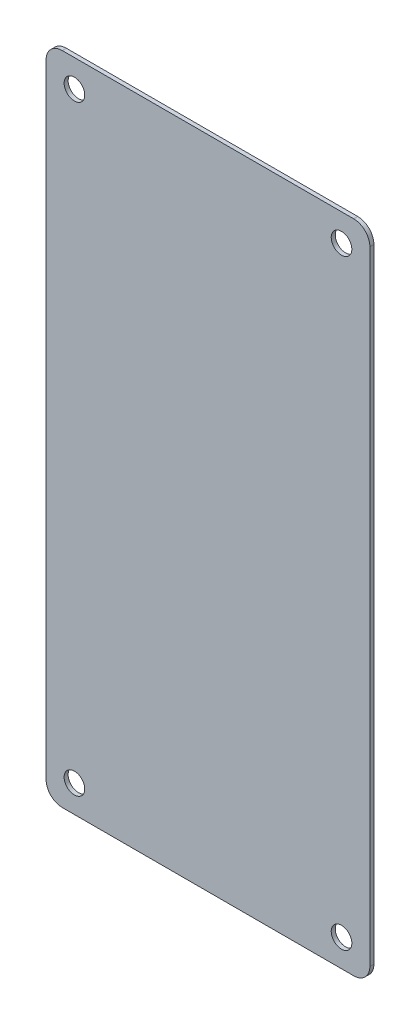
from build123d import *

# Parameters (mm, degrees)
SKETCH1_W           = 80
SKETCH1_H           = 162
BOSS_EXTRUDE1_DEPTH = 1
FILLET1_R           = 4
SKETCH2_R           = 2.55
CUT_EXTRUDE1_DEPTH  = 91.343787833


with BuildPart() as part:
    # Sketch1 → Boss-Extrude1 (new body)
    with BuildSketch(Plane.XY):
        Rectangle(SKETCH1_W, SKETCH1_H)
    extrude(amount=BOSS_EXTRUDE1_DEPTH)

    # Fillet1
    fillet1_edges = [part.edges().sort_by_distance(p)[0] for p in [
        (40, -81, 0.5),
        (-40, -81, 0.5),
        (-40, 81, 0.5),
        (40, 81, 0.5),
    ]]
    fillet(fillet1_edges, radius=FILLET1_R)

    # Sketch2 → Cut-Extrude1 (cut, through all)
    with BuildSketch(Plane(origin=(0, 0, 0), x_dir=(-1, 0, 0), z_dir=(0, 0, -1))):
        with Locations((-33, -74.25)):
            Circle(SKETCH2_R)
        with Locations((-33, 74.25)):
            Circle(SKETCH2_R)
        with Locations((33, 74.25)):
            Circle(SKETCH2_R)
        with Locations((33, -74.25)):
            Circle(SKETCH2_R)
    extrude(amount=-CUT_EXTRUDE1_DEPTH, mode=Mode.SUBTRACT)


solid = part.part
